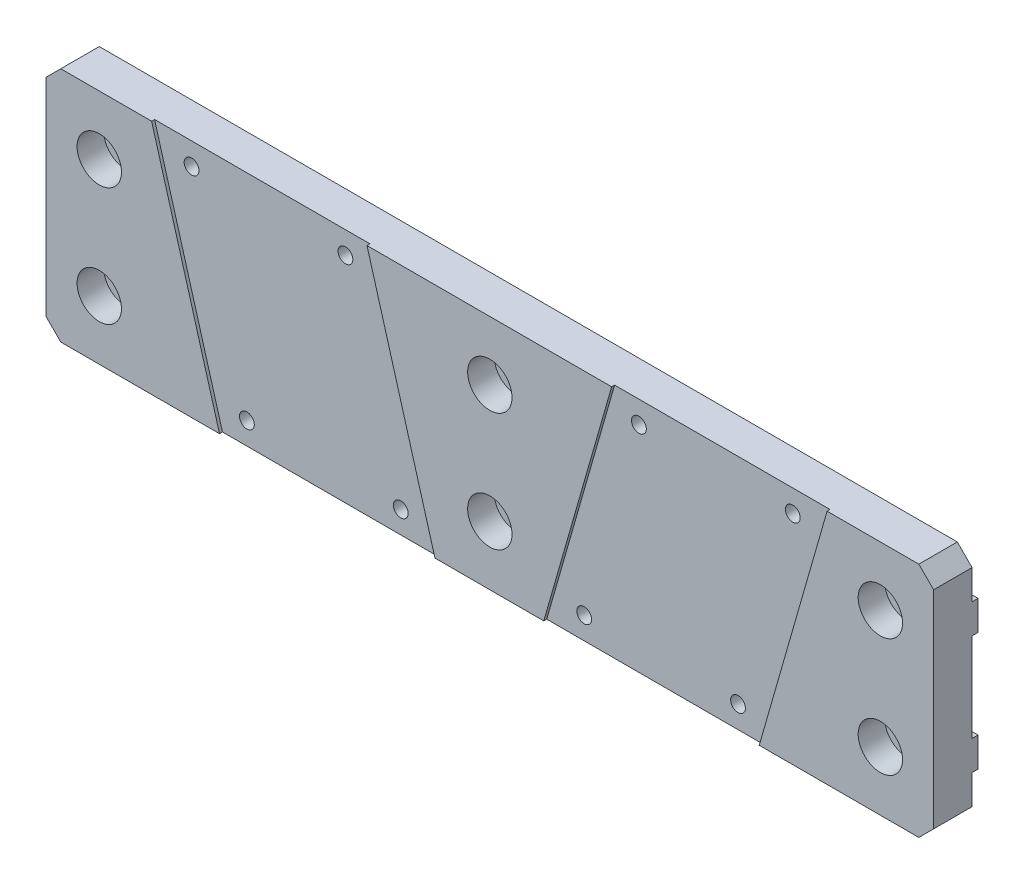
ISO-10303-21;
HEADER;
FILE_DESCRIPTION(('STEP AP214'),'2;1');
FILE_NAME('part.step','',(''),(''),'','','');
FILE_SCHEMA(('AUTOMOTIVE_DESIGN { 1 0 10303 214 1 1 1 1 }'));
ENDSEC;
DATA;
#1=APPLICATION_CONTEXT('core data for automotive mechanical design processes');
#2=APPLICATION_PROTOCOL_DEFINITION('international standard','automotive_design',2000,#1);
#3=PRODUCT_CONTEXT('',#1,'mechanical');
#4=PRODUCT('Part','Part','',(#3));
#5=PRODUCT_RELATED_PRODUCT_CATEGORY('part','',(#4));
#6=PRODUCT_DEFINITION_FORMATION('','',#4);
#7=PRODUCT_DEFINITION_CONTEXT('part definition',#1,'design');
#8=PRODUCT_DEFINITION('design','',#6,#7);
#9=PRODUCT_DEFINITION_SHAPE('','',#8);
#10=(LENGTH_UNIT() NAMED_UNIT(*) SI_UNIT(.MILLI.,.METRE.));
#11=(NAMED_UNIT(*) PLANE_ANGLE_UNIT() SI_UNIT($,.RADIAN.));
#12=(NAMED_UNIT(*) SI_UNIT($,.STERADIAN.) SOLID_ANGLE_UNIT());
#13=UNCERTAINTY_MEASURE_WITH_UNIT(LENGTH_MEASURE(1.E-05),#10,'distance_accuracy_value','');
#14=(GEOMETRIC_REPRESENTATION_CONTEXT(3) GLOBAL_UNCERTAINTY_ASSIGNED_CONTEXT((#13)) GLOBAL_UNIT_ASSIGNED_CONTEXT((#10,
#11,#12)) REPRESENTATION_CONTEXT('',''));
#15=CARTESIAN_POINT('',(0.,0.,0.));
#16=DIRECTION('',(0.,0.,1.));
#17=DIRECTION('',(1.,0.,0.));
#18=AXIS2_PLACEMENT_3D('',#15,#16,#17);
#19=CARTESIAN_POINT('',(0.,0.,0.));
#20=DIRECTION('',(0.,0.,-1.));
#21=DIRECTION('',(-1.,0.,0.));
#22=AXIS2_PLACEMENT_3D('',#19,#20,#21);
#23=PLANE('',#22);
#24=CARTESIAN_POINT('',(93.6480387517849,-32.5,0.));
#25=DIRECTION('',(0.,0.,-1.));
#26=DIRECTION('',(-1.,0.,0.));
#27=AXIS2_PLACEMENT_3D('',#24,#25,#26);
#28=CIRCLE('',#27,2.5);
#29=CARTESIAN_POINT('',(91.1480387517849,-32.5,0.));
#30=VERTEX_POINT('',#29);
#31=EDGE_CURVE('E741',#30,#30,#28,.T.);
#32=ORIENTED_EDGE('',*,*,#31,.F.);
#33=EDGE_LOOP('',(#32));
#34=FACE_BOUND('',#33,.T.);
#35=CARTESIAN_POINT('',(145.648038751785,-32.5,0.));
#36=DIRECTION('',(0.,0.,-1.));
#37=DIRECTION('',(-1.,0.,0.));
#38=AXIS2_PLACEMENT_3D('',#35,#36,#37);
#39=CIRCLE('',#38,2.5);
#40=CARTESIAN_POINT('',(143.148038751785,-32.5,0.));
#41=VERTEX_POINT('',#40);
#42=EDGE_CURVE('E747',#41,#41,#39,.T.);
#43=ORIENTED_EDGE('',*,*,#42,.F.);
#44=EDGE_LOOP('',(#43));
#45=FACE_BOUND('',#44,.T.);
#46=CARTESIAN_POINT('',(207.648038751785,-32.5,0.));
#47=DIRECTION('',(0.,0.,-1.));
#48=DIRECTION('',(-1.,0.,0.));
#49=AXIS2_PLACEMENT_3D('',#46,#47,#48);
#50=CIRCLE('',#49,2.5);
#51=CARTESIAN_POINT('',(205.148038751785,-32.5,0.));
#52=VERTEX_POINT('',#51);
#53=EDGE_CURVE('E765',#52,#52,#50,.T.);
#54=ORIENTED_EDGE('',*,*,#53,.F.);
#55=EDGE_LOOP('',(#54));
#56=FACE_BOUND('',#55,.T.);
#57=CARTESIAN_POINT('',(259.648038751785,-32.5,0.));
#58=DIRECTION('',(0.,0.,-1.));
#59=DIRECTION('',(-1.,0.,0.));
#60=AXIS2_PLACEMENT_3D('',#57,#58,#59);
#61=CIRCLE('',#60,2.5);
#62=CARTESIAN_POINT('',(257.148038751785,-32.5,0.));
#63=VERTEX_POINT('',#62);
#64=EDGE_CURVE('E20',#63,#63,#61,.T.);
#65=ORIENTED_EDGE('',*,*,#64,.F.);
#66=EDGE_LOOP('',(#65));
#67=FACE_BOUND('',#66,.T.);
#68=DIRECTION('',(1.,0.,0.));
#69=VECTOR('',#68,1.);
#70=CARTESIAN_POINT('',(26.748038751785,-40.,0.));
#71=LINE('',#70,#69);
#72=CARTESIAN_POINT('',(31.748038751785,-40.,0.));
#73=VERTEX_POINT('',#72);
#74=CARTESIAN_POINT('',(321.748038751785,-40.,0.));
#75=VERTEX_POINT('',#74);
#76=EDGE_CURVE('E322',#73,#75,#71,.T.);
#77=ORIENTED_EDGE('',*,*,#76,.F.);
#78=DIRECTION('',(0.707106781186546,-0.70710678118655,0.));
#79=VECTOR('',#78,1.);
#80=CARTESIAN_POINT('',(-4.12598062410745,-4.12598062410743,0.));
#81=LINE('',#80,#79);
#82=CARTESIAN_POINT('',(26.748038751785,-35.,0.));
#83=VERTEX_POINT('',#82);
#84=EDGE_CURVE('E337',#73,#83,#81,.F.);
#85=ORIENTED_EDGE('',*,*,#84,.T.);
#86=DIRECTION('',(0.,-1.,0.));
#87=VECTOR('',#86,1.);
#88=CARTESIAN_POINT('',(26.748038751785,-40.,0.));
#89=LINE('',#88,#87);
#90=CARTESIAN_POINT('',(26.748038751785,-25.,-4.61436444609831E-13));
#91=VERTEX_POINT('',#90);
#92=EDGE_CURVE('E316',#91,#83,#89,.T.);
#93=ORIENTED_EDGE('',*,*,#92,.F.);
#94=DIRECTION('',(1.,0.,0.));
#95=VECTOR('',#94,1.);
#96=CARTESIAN_POINT('',(26.748038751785,-25.,-4.61436444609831E-13));
#97=LINE('',#96,#95);
#98=CARTESIAN_POINT('',(326.748038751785,-25.,-4.61436444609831E-13));
#99=VERTEX_POINT('',#98);
#100=EDGE_CURVE('E272',#91,#99,#97,.T.);
#101=ORIENTED_EDGE('',*,*,#100,.T.);
#102=DIRECTION('',(0.,1.,0.));
#103=VECTOR('',#102,1.);
#104=CARTESIAN_POINT('',(326.748038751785,-40.,0.));
#105=LINE('',#104,#103);
#106=CARTESIAN_POINT('',(326.748038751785,-35.,0.));
#107=VERTEX_POINT('',#106);
#108=EDGE_CURVE('E314',#107,#99,#105,.T.);
#109=ORIENTED_EDGE('',*,*,#108,.F.);
#110=DIRECTION('',(0.707106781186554,0.707106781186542,0.));
#111=VECTOR('',#110,1.);
#112=CARTESIAN_POINT('',(180.87401937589,-180.874019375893,0.));
#113=LINE('',#112,#111);
#114=EDGE_CURVE('E335',#107,#75,#113,.F.);
#115=ORIENTED_EDGE('',*,*,#114,.T.);
#116=EDGE_LOOP('',(#77,#85,#93,#101,#109,#115));
#117=FACE_BOUND('',#116,.T.);
#118=ADVANCED_FACE('F16',(#34,#45,#56,#67,#117),#23,.T.);
#119=DIRECTION('',(1.,0.,0.));
#120=VECTOR('',#119,1.);
#121=CARTESIAN_POINT('',(26.748038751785,-15.,-2.78816156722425E-13));
#122=LINE('',#121,#120);
#123=CARTESIAN_POINT('',(26.748038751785,-15.,-2.78816156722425E-13));
#124=VERTEX_POINT('',#123);
#125=CARTESIAN_POINT('',(326.748038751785,-15.,0.));
#126=VERTEX_POINT('',#125);
#127=EDGE_CURVE('E276',#124,#126,#122,.T.);
#128=ORIENTED_EDGE('',*,*,#127,.F.);
#129=CARTESIAN_POINT('',(26.748038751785,15.,0.));
#130=VERTEX_POINT('',#129);
#131=EDGE_CURVE('E395',#130,#124,#89,.T.);
#132=ORIENTED_EDGE('',*,*,#131,.F.);
#133=DIRECTION('',(1.,0.,0.));
#134=VECTOR('',#133,1.);
#135=CARTESIAN_POINT('',(26.748038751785,15.,0.));
#136=LINE('',#135,#134);
#137=CARTESIAN_POINT('',(326.748038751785,15.,0.));
#138=VERTEX_POINT('',#137);
#139=EDGE_CURVE('E304',#130,#138,#136,.T.);
#140=ORIENTED_EDGE('',*,*,#139,.T.);
#141=EDGE_CURVE('E311',#126,#138,#105,.T.);
#142=ORIENTED_EDGE('',*,*,#141,.F.);
#143=EDGE_LOOP('',(#128,#132,#140,#142));
#144=FACE_BOUND('',#143,.T.);
#145=ADVANCED_FACE('F509',(#144),#23,.T.);
#146=CARTESIAN_POINT('',(0.,0.,13.));
#147=DIRECTION('',(0.,0.,-1.));
#148=DIRECTION('',(-1.,0.,0.));
#149=AXIS2_PLACEMENT_3D('',#146,#147,#148);
#150=PLANE('',#149);
#151=CARTESIAN_POINT('',(176.748038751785,20.,13.));
#152=DIRECTION('',(0.,0.,1.));
#153=DIRECTION('',(1.,0.,0.));
#154=AXIS2_PLACEMENT_3D('',#151,#152,#153);
#155=CIRCLE('',#154,7.5);
#156=CARTESIAN_POINT('',(184.248038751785,20.,13.));
#157=VERTEX_POINT('',#156);
#158=EDGE_CURVE('E215',#157,#157,#155,.T.);
#159=ORIENTED_EDGE('',*,*,#158,.F.);
#160=EDGE_LOOP('',(#159));
#161=FACE_BOUND('',#160,.T.);
#162=CARTESIAN_POINT('',(176.748038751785,-20.,13.));
#163=DIRECTION('',(0.,0.,1.));
#164=DIRECTION('',(1.,0.,0.));
#165=AXIS2_PLACEMENT_3D('',#162,#163,#164);
#166=CIRCLE('',#165,7.5);
#167=CARTESIAN_POINT('',(184.248038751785,-20.,13.));
#168=VERTEX_POINT('',#167);
#169=EDGE_CURVE('E225',#168,#168,#166,.T.);
#170=ORIENTED_EDGE('',*,*,#169,.F.);
#171=EDGE_LOOP('',(#170));
#172=FACE_BOUND('',#171,.T.);
#173=DIRECTION('',(1.,0.,0.));
#174=VECTOR('',#173,1.);
#175=CARTESIAN_POINT('',(26.748038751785,-40.,13.));
#176=LINE('',#175,#174);
#177=CARTESIAN_POINT('',(158.208429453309,-40.,13.));
#178=VERTEX_POINT('',#177);
#179=CARTESIAN_POINT('',(194.985221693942,-40.,13.));
#180=VERTEX_POINT('',#179);
#181=EDGE_CURVE('E444',#178,#180,#176,.T.);
#182=ORIENTED_EDGE('',*,*,#181,.T.);
#183=DIRECTION('',(-0.275637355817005,-0.961261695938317,0.));
#184=VECTOR('',#183,1.);
#185=CARTESIAN_POINT('',(194.833044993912,-40.5307032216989,13.));
#186=LINE('',#185,#184);
#187=CARTESIAN_POINT('',(217.924852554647,40.,13.));
#188=VERTEX_POINT('',#187);
#189=EDGE_CURVE('E452',#188,#180,#186,.T.);
#190=ORIENTED_EDGE('',*,*,#189,.F.);
#191=DIRECTION('',(-1.,0.,0.));
#192=VECTOR('',#191,1.);
#193=CARTESIAN_POINT('',(26.748038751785,40.,13.));
#194=LINE('',#193,#192);
#195=CARTESIAN_POINT('',(135.238548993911,40.,13.));
#196=VERTEX_POINT('',#195);
#197=EDGE_CURVE('E362',#188,#196,#194,.T.);
#198=ORIENTED_EDGE('',*,*,#197,.T.);
#199=DIRECTION('',(0.275973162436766,-0.961165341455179,0.));
#200=VECTOR('',#199,1.);
#201=CARTESIAN_POINT('',(135.548854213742,38.9192622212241,13.));
#202=LINE('',#201,#200);
#203=EDGE_CURVE('E361',#196,#178,#202,.T.);
#204=ORIENTED_EDGE('',*,*,#203,.T.);
#205=EDGE_LOOP('',(#182,#190,#198,#204));
#206=FACE_BOUND('',#205,.T.);
#207=ADVANCED_FACE('F451',(#161,#172,#206),#150,.F.);
#208=CARTESIAN_POINT('',(308.748038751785,20.,13.));
#209=DIRECTION('',(0.,0.,1.));
#210=DIRECTION('',(1.,0.,0.));
#211=AXIS2_PLACEMENT_3D('',#208,#209,#210);
#212=CIRCLE('',#211,7.5);
#213=CARTESIAN_POINT('',(316.248038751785,20.,13.));
#214=VERTEX_POINT('',#213);
#215=EDGE_CURVE('E235',#214,#214,#212,.T.);
#216=ORIENTED_EDGE('',*,*,#215,.F.);
#217=EDGE_LOOP('',(#216));
#218=FACE_BOUND('',#217,.T.);
#219=CARTESIAN_POINT('',(308.748038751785,-20.,13.));
#220=DIRECTION('',(0.,0.,1.));
#221=DIRECTION('',(1.,0.,0.));
#222=AXIS2_PLACEMENT_3D('',#219,#220,#221);
#223=CIRCLE('',#222,7.5);
#224=CARTESIAN_POINT('',(316.248038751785,-20.,13.));
#225=VERTEX_POINT('',#224);
#226=EDGE_CURVE('E245',#225,#225,#223,.T.);
#227=ORIENTED_EDGE('',*,*,#226,.F.);
#228=EDGE_LOOP('',(#227));
#229=FACE_BOUND('',#228,.T.);
#230=CARTESIAN_POINT('',(267.806182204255,-40.,13.));
#231=VERTEX_POINT('',#230);
#232=CARTESIAN_POINT('',(321.748038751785,-40.,13.));
#233=VERTEX_POINT('',#232);
#234=EDGE_CURVE('E442',#231,#233,#176,.T.);
#235=ORIENTED_EDGE('',*,*,#234,.T.);
#236=DIRECTION('',(-0.707106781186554,-0.707106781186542,0.));
#237=VECTOR('',#236,1.);
#238=CARTESIAN_POINT('',(326.748038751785,-35.,13.));
#239=LINE('',#238,#237);
#240=CARTESIAN_POINT('',(326.748038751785,-35.,13.));
#241=VERTEX_POINT('',#240);
#242=EDGE_CURVE('E11',#233,#241,#239,.F.);
#243=ORIENTED_EDGE('',*,*,#242,.T.);
#244=DIRECTION('',(0.,1.,0.));
#245=VECTOR('',#244,1.);
#246=CARTESIAN_POINT('',(326.748038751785,-40.,13.));
#247=LINE('',#246,#245);
#248=CARTESIAN_POINT('',(326.748038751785,35.,13.));
#249=VERTEX_POINT('',#248);
#250=EDGE_CURVE('E349',#241,#249,#247,.T.);
#251=ORIENTED_EDGE('',*,*,#250,.T.);
#252=DIRECTION('',(0.707106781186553,-0.707106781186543,0.));
#253=VECTOR('',#252,1.);
#254=CARTESIAN_POINT('',(321.748038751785,40.,13.));
#255=LINE('',#254,#253);
#256=CARTESIAN_POINT('',(321.748038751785,40.,13.));
#257=VERTEX_POINT('',#256);
#258=EDGE_CURVE('E25',#249,#257,#255,.F.);
#259=ORIENTED_EDGE('',*,*,#258,.T.);
#260=CARTESIAN_POINT('',(290.74581306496,40.,13.));
#261=VERTEX_POINT('',#260);
#262=EDGE_CURVE('E347',#257,#261,#194,.T.);
#263=ORIENTED_EDGE('',*,*,#262,.T.);
#264=DIRECTION('',(0.275637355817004,0.961261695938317,0.));
#265=VECTOR('',#264,1.);
#266=CARTESIAN_POINT('',(262.121363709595,-59.8253181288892,13.));
#267=LINE('',#266,#265);
#268=EDGE_CURVE('E299',#231,#261,#267,.T.);
#269=ORIENTED_EDGE('',*,*,#268,.F.);
#270=EDGE_LOOP('',(#235,#243,#251,#259,#263,#269));
#271=FACE_BOUND('',#270,.T.);
#272=ADVANCED_FACE('F345',(#218,#229,#271),#150,.F.);
#273=CARTESIAN_POINT('',(26.748038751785,-40.,13.));
#274=DIRECTION('',(1.,0.,0.));
#275=DIRECTION('',(0.,0.,-1.));
#276=AXIS2_PLACEMENT_3D('',#273,#274,#275);
#277=PLANE('',#276);
#278=CARTESIAN_POINT('',(26.748038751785,0.,6.));
#279=DIRECTION('',(-1.,0.,0.));
#280=DIRECTION('',(0.,0.,1.));
#281=AXIS2_PLACEMENT_3D('',#278,#279,#280);
#282=CIRCLE('',#281,2.5);
#283=CARTESIAN_POINT('',(26.748038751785,0.,8.5));
#284=VERTEX_POINT('',#283);
#285=EDGE_CURVE('E190',#284,#284,#282,.T.);
#286=ORIENTED_EDGE('',*,*,#285,.F.);
#287=EDGE_LOOP('',(#286));
#288=FACE_BOUND('',#287,.T.);
#289=DIRECTION('',(0.,-1.,0.));
#290=VECTOR('',#289,1.);
#291=CARTESIAN_POINT('',(26.748038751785,-40.,13.));
#292=LINE('',#291,#290);
#293=CARTESIAN_POINT('',(26.748038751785,35.,13.));
#294=VERTEX_POINT('',#293);
#295=CARTESIAN_POINT('',(26.748038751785,-35.,13.));
#296=VERTEX_POINT('',#295);
#297=EDGE_CURVE('E435',#294,#296,#292,.T.);
#298=ORIENTED_EDGE('',*,*,#297,.F.);
#299=DIRECTION('',(0.,0.,-1.));
#300=VECTOR('',#299,1.);
#301=CARTESIAN_POINT('',(26.748038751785,35.,13.));
#302=LINE('',#301,#300);
#303=CARTESIAN_POINT('',(26.748038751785,35.,0.));
#304=VERTEX_POINT('',#303);
#305=EDGE_CURVE('E416',#294,#304,#302,.T.);
#306=ORIENTED_EDGE('',*,*,#305,.T.);
#307=CARTESIAN_POINT('',(26.748038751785,25.,0.));
#308=VERTEX_POINT('',#307);
#309=EDGE_CURVE('E394',#304,#308,#89,.T.);
#310=ORIENTED_EDGE('',*,*,#309,.T.);
#311=DIRECTION('',(0.,0.,1.));
#312=VECTOR('',#311,1.);
#313=CARTESIAN_POINT('',(26.748038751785,25.,0.));
#314=LINE('',#313,#312);
#315=CARTESIAN_POINT('',(26.748038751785,25.,-2.));
#316=VERTEX_POINT('',#315);
#317=EDGE_CURVE('E285',#316,#308,#314,.T.);
#318=ORIENTED_EDGE('',*,*,#317,.F.);
#319=DIRECTION('',(0.,1.,0.));
#320=VECTOR('',#319,1.);
#321=CARTESIAN_POINT('',(26.748038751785,25.,-2.));
#322=LINE('',#321,#320);
#323=CARTESIAN_POINT('',(26.748038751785,15.,-2.));
#324=VERTEX_POINT('',#323);
#325=EDGE_CURVE('E282',#324,#316,#322,.T.);
#326=ORIENTED_EDGE('',*,*,#325,.F.);
#327=DIRECTION('',(0.,0.,-1.));
#328=VECTOR('',#327,1.);
#329=CARTESIAN_POINT('',(26.748038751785,15.,0.));
#330=LINE('',#329,#328);
#331=EDGE_CURVE('E286',#130,#324,#330,.T.);
#332=ORIENTED_EDGE('',*,*,#331,.F.);
#333=ORIENTED_EDGE('',*,*,#131,.T.);
#334=DIRECTION('',(0.,0.,1.));
#335=VECTOR('',#334,1.);
#336=CARTESIAN_POINT('',(26.748038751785,-15.,-2.78816156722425E-13));
#337=LINE('',#336,#335);
#338=CARTESIAN_POINT('',(26.748038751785,-14.9999999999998,-2.00000000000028));
#339=VERTEX_POINT('',#338);
#340=EDGE_CURVE('E262',#339,#124,#337,.T.);
#341=ORIENTED_EDGE('',*,*,#340,.F.);
#342=DIRECTION('',(0.,1.,0.));
#343=VECTOR('',#342,1.);
#344=CARTESIAN_POINT('',(26.748038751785,-25.,-2.00000000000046));
#345=LINE('',#344,#343);
#346=CARTESIAN_POINT('',(26.748038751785,-25.,-2.00000000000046));
#347=VERTEX_POINT('',#346);
#348=EDGE_CURVE('E258',#347,#339,#345,.T.);
#349=ORIENTED_EDGE('',*,*,#348,.F.);
#350=DIRECTION('',(0.,0.,-1.));
#351=VECTOR('',#350,1.);
#352=CARTESIAN_POINT('',(26.748038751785,-25.,-4.61436444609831E-13));
#353=LINE('',#352,#351);
#354=EDGE_CURVE('E255',#91,#347,#353,.T.);
#355=ORIENTED_EDGE('',*,*,#354,.F.);
#356=ORIENTED_EDGE('',*,*,#92,.T.);
#357=DIRECTION('',(0.,0.,1.));
#358=VECTOR('',#357,1.);
#359=CARTESIAN_POINT('',(26.748038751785,-35.,13.));
#360=LINE('',#359,#358);
#361=EDGE_CURVE('E405',#83,#296,#360,.T.);
#362=ORIENTED_EDGE('',*,*,#361,.T.);
#363=EDGE_LOOP('',(#298,#306,#310,#318,#326,#332,#333,#341,#349,#355,#356,#362));
#364=FACE_BOUND('',#363,.T.);
#365=ADVANCED_FACE('F441',(#288,#364),#277,.F.);
#366=CARTESIAN_POINT('',(26.748038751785,-40.,13.));
#367=DIRECTION('',(0.,1.,0.));
#368=DIRECTION('',(-1.,0.,0.));
#369=AXIS2_PLACEMENT_3D('',#366,#367,#368);
#370=PLANE('',#369);
#371=CARTESIAN_POINT('',(31.748038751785,-40.,13.));
#372=VERTEX_POINT('',#371);
#373=CARTESIAN_POINT('',(85.3876696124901,-40.,13.));
#374=VERTEX_POINT('',#373);
#375=EDGE_CURVE('E387',#372,#374,#176,.T.);
#376=ORIENTED_EDGE('',*,*,#375,.F.);
#377=DIRECTION('',(0.,0.,-1.));
#378=VECTOR('',#377,1.);
#379=CARTESIAN_POINT('',(31.748038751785,-40.,13.));
#380=LINE('',#379,#378);
#381=EDGE_CURVE('E333',#372,#73,#380,.T.);
#382=ORIENTED_EDGE('',*,*,#381,.T.);
#383=ORIENTED_EDGE('',*,*,#76,.T.);
#384=DIRECTION('',(0.,0.,1.));
#385=VECTOR('',#384,1.);
#386=CARTESIAN_POINT('',(321.748038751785,-40.,13.));
#387=LINE('',#386,#385);
#388=EDGE_CURVE('E376',#75,#233,#387,.T.);
#389=ORIENTED_EDGE('',*,*,#388,.T.);
#390=ORIENTED_EDGE('',*,*,#234,.F.);
#391=DIRECTION('',(0.,0.,-1.));
#392=VECTOR('',#391,1.);
#393=CARTESIAN_POINT('',(267.806182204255,-40.,13.));
#394=LINE('',#393,#392);
#395=CARTESIAN_POINT('',(267.806182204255,-40.,12.));
#396=VERTEX_POINT('',#395);
#397=EDGE_CURVE('E488',#231,#396,#394,.T.);
#398=ORIENTED_EDGE('',*,*,#397,.T.);
#399=DIRECTION('',(1.,0.,0.));
#400=VECTOR('',#399,1.);
#401=CARTESIAN_POINT('',(26.748038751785,-40.,12.));
#402=LINE('',#401,#400);
#403=CARTESIAN_POINT('',(194.985221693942,-40.,12.));
#404=VERTEX_POINT('',#403);
#405=EDGE_CURVE('E492',#404,#396,#402,.T.);
#406=ORIENTED_EDGE('',*,*,#405,.F.);
#407=DIRECTION('',(0.,0.,1.));
#408=VECTOR('',#407,1.);
#409=CARTESIAN_POINT('',(194.985221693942,-40.,13.));
#410=LINE('',#409,#408);
#411=EDGE_CURVE('E484',#404,#180,#410,.T.);
#412=ORIENTED_EDGE('',*,*,#411,.T.);
#413=ORIENTED_EDGE('',*,*,#181,.F.);
#414=DIRECTION('',(0.,0.,-1.));
#415=VECTOR('',#414,1.);
#416=CARTESIAN_POINT('',(158.208429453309,-40.,13.));
#417=LINE('',#416,#415);
#418=CARTESIAN_POINT('',(158.208429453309,-40.,12.));
#419=VERTEX_POINT('',#418);
#420=EDGE_CURVE('E462',#178,#419,#417,.T.);
#421=ORIENTED_EDGE('',*,*,#420,.T.);
#422=DIRECTION('',(1.,0.,0.));
#423=VECTOR('',#422,1.);
#424=CARTESIAN_POINT('',(26.748038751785,-40.,12.));
#425=LINE('',#424,#423);
#426=CARTESIAN_POINT('',(85.3876696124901,-40.,12.));
#427=VERTEX_POINT('',#426);
#428=EDGE_CURVE('E447',#427,#419,#425,.T.);
#429=ORIENTED_EDGE('',*,*,#428,.F.);
#430=DIRECTION('',(0.,0.,1.));
#431=VECTOR('',#430,1.);
#432=CARTESIAN_POINT('',(85.3876696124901,-40.,13.));
#433=LINE('',#432,#431);
#434=EDGE_CURVE('E466',#427,#374,#433,.T.);
#435=ORIENTED_EDGE('',*,*,#434,.T.);
#436=EDGE_LOOP('',(#376,#382,#383,#389,#390,#398,#406,#412,#413,#421,#429,#435));
#437=FACE_BOUND('',#436,.T.);
#438=ADVANCED_FACE('F385',(#437),#370,.F.);
#439=CARTESIAN_POINT('',(326.748038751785,-40.,13.));
#440=DIRECTION('',(-1.,0.,0.));
#441=DIRECTION('',(0.,0.,1.));
#442=AXIS2_PLACEMENT_3D('',#439,#440,#441);
#443=PLANE('',#442);
#444=ORIENTED_EDGE('',*,*,#250,.F.);
#445=DIRECTION('',(0.,0.,-1.));
#446=VECTOR('',#445,1.);
#447=CARTESIAN_POINT('',(326.748038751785,-35.,13.));
#448=LINE('',#447,#446);
#449=EDGE_CURVE('E340',#241,#107,#448,.T.);
#450=ORIENTED_EDGE('',*,*,#449,.T.);
#451=ORIENTED_EDGE('',*,*,#108,.T.);
#452=DIRECTION('',(0.,0.,-1.));
#453=VECTOR('',#452,1.);
#454=CARTESIAN_POINT('',(326.748038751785,-25.,-4.61436444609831E-13));
#455=LINE('',#454,#453);
#456=CARTESIAN_POINT('',(326.748038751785,-25.,-2.00000000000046));
#457=VERTEX_POINT('',#456);
#458=EDGE_CURVE('E265',#99,#457,#455,.T.);
#459=ORIENTED_EDGE('',*,*,#458,.T.);
#460=DIRECTION('',(0.,1.,0.));
#461=VECTOR('',#460,1.);
#462=CARTESIAN_POINT('',(326.748038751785,-25.,-2.00000000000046));
#463=LINE('',#462,#461);
#464=CARTESIAN_POINT('',(326.748038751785,-14.9999999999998,-2.00000000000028));
#465=VERTEX_POINT('',#464);
#466=EDGE_CURVE('E268',#457,#465,#463,.T.);
#467=ORIENTED_EDGE('',*,*,#466,.T.);
#468=DIRECTION('',(0.,0.,1.));
#469=VECTOR('',#468,1.);
#470=CARTESIAN_POINT('',(326.748038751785,-15.,-2.78816156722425E-13));
#471=LINE('',#470,#469);
#472=EDGE_CURVE('E259',#465,#126,#471,.T.);
#473=ORIENTED_EDGE('',*,*,#472,.T.);
#474=ORIENTED_EDGE('',*,*,#141,.T.);
#475=DIRECTION('',(0.,0.,-1.));
#476=VECTOR('',#475,1.);
#477=CARTESIAN_POINT('',(326.748038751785,15.,0.));
#478=LINE('',#477,#476);
#479=CARTESIAN_POINT('',(326.748038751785,15.,-2.));
#480=VERTEX_POINT('',#479);
#481=EDGE_CURVE('E275',#138,#480,#478,.T.);
#482=ORIENTED_EDGE('',*,*,#481,.T.);
#483=DIRECTION('',(0.,1.,0.));
#484=VECTOR('',#483,1.);
#485=CARTESIAN_POINT('',(326.748038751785,25.,-2.));
#486=LINE('',#485,#484);
#487=CARTESIAN_POINT('',(326.748038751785,25.,-2.));
#488=VERTEX_POINT('',#487);
#489=EDGE_CURVE('E287',#480,#488,#486,.T.);
#490=ORIENTED_EDGE('',*,*,#489,.T.);
#491=DIRECTION('',(0.,0.,1.));
#492=VECTOR('',#491,1.);
#493=CARTESIAN_POINT('',(326.748038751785,25.,0.));
#494=LINE('',#493,#492);
#495=CARTESIAN_POINT('',(326.748038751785,25.,0.));
#496=VERTEX_POINT('',#495);
#497=EDGE_CURVE('E290',#488,#496,#494,.T.);
#498=ORIENTED_EDGE('',*,*,#497,.T.);
#499=CARTESIAN_POINT('',(326.748038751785,35.,0.));
#500=VERTEX_POINT('',#499);
#501=EDGE_CURVE('E315',#496,#500,#105,.T.);
#502=ORIENTED_EDGE('',*,*,#501,.T.);
#503=DIRECTION('',(0.,0.,1.));
#504=VECTOR('',#503,1.);
#505=CARTESIAN_POINT('',(326.748038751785,35.,13.));
#506=LINE('',#505,#504);
#507=EDGE_CURVE('E32',#500,#249,#506,.T.);
#508=ORIENTED_EDGE('',*,*,#507,.T.);
#509=EDGE_LOOP('',(#444,#450,#451,#459,#467,#473,#474,#482,#490,#498,#502,#508));
#510=FACE_BOUND('',#509,.T.);
#511=ADVANCED_FACE('F425',(#510),#443,.F.);
#512=CARTESIAN_POINT('',(26.748038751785,40.,13.));
#513=DIRECTION('',(0.,-1.,0.));
#514=DIRECTION('',(1.,0.,0.));
#515=AXIS2_PLACEMENT_3D('',#512,#513,#514);
#516=PLANE('',#515);
#517=DIRECTION('',(-1.,0.,0.));
#518=VECTOR('',#517,1.);
#519=CARTESIAN_POINT('',(26.748038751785,40.,0.));
#520=LINE('',#519,#518);
#521=CARTESIAN_POINT('',(321.748038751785,40.,0.));
#522=VERTEX_POINT('',#521);
#523=CARTESIAN_POINT('',(31.748038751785,40.,0.));
#524=VERTEX_POINT('',#523);
#525=EDGE_CURVE('E323',#522,#524,#520,.T.);
#526=ORIENTED_EDGE('',*,*,#525,.T.);
#527=DIRECTION('',(0.,0.,1.));
#528=VECTOR('',#527,1.);
#529=CARTESIAN_POINT('',(31.748038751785,40.,13.));
#530=LINE('',#529,#528);
#531=CARTESIAN_POINT('',(31.748038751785,40.,13.));
#532=VERTEX_POINT('',#531);
#533=EDGE_CURVE('E366',#524,#532,#530,.T.);
#534=ORIENTED_EDGE('',*,*,#533,.T.);
#535=CARTESIAN_POINT('',(62.4480387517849,40.,13.));
#536=VERTEX_POINT('',#535);
#537=EDGE_CURVE('E364',#536,#532,#194,.T.);
#538=ORIENTED_EDGE('',*,*,#537,.F.);
#539=DIRECTION('',(0.,0.,1.));
#540=VECTOR('',#539,1.);
#541=CARTESIAN_POINT('',(62.4480387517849,40.,12.));
#542=LINE('',#541,#540);
#543=CARTESIAN_POINT('',(62.4480387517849,40.,12.));
#544=VERTEX_POINT('',#543);
#545=EDGE_CURVE('E467',#544,#536,#542,.T.);
#546=ORIENTED_EDGE('',*,*,#545,.F.);
#547=DIRECTION('',(-1.,0.,0.));
#548=VECTOR('',#547,1.);
#549=CARTESIAN_POINT('',(62.4480387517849,40.,12.));
#550=LINE('',#549,#548);
#551=CARTESIAN_POINT('',(135.238548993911,40.,12.));
#552=VERTEX_POINT('',#551);
#553=EDGE_CURVE('E465',#552,#544,#550,.T.);
#554=ORIENTED_EDGE('',*,*,#553,.F.);
#555=DIRECTION('',(0.,0.,1.));
#556=VECTOR('',#555,1.);
#557=CARTESIAN_POINT('',(135.238548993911,40.,12.));
#558=LINE('',#557,#556);
#559=EDGE_CURVE('E459',#552,#196,#558,.T.);
#560=ORIENTED_EDGE('',*,*,#559,.T.);
#561=ORIENTED_EDGE('',*,*,#197,.F.);
#562=DIRECTION('',(0.,0.,1.));
#563=VECTOR('',#562,1.);
#564=CARTESIAN_POINT('',(217.924852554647,40.,12.));
#565=LINE('',#564,#563);
#566=CARTESIAN_POINT('',(217.924852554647,40.,12.));
#567=VERTEX_POINT('',#566);
#568=EDGE_CURVE('E582',#567,#188,#565,.T.);
#569=ORIENTED_EDGE('',*,*,#568,.F.);
#570=DIRECTION('',(-1.,0.,0.));
#571=VECTOR('',#570,1.);
#572=CARTESIAN_POINT('',(217.924852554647,40.,12.));
#573=LINE('',#572,#571);
#574=CARTESIAN_POINT('',(290.74581306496,40.,12.));
#575=VERTEX_POINT('',#574);
#576=EDGE_CURVE('E575',#575,#567,#573,.T.);
#577=ORIENTED_EDGE('',*,*,#576,.F.);
#578=DIRECTION('',(0.,0.,1.));
#579=VECTOR('',#578,1.);
#580=CARTESIAN_POINT('',(290.74581306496,40.,12.));
#581=LINE('',#580,#579);
#582=EDGE_CURVE('E360',#575,#261,#581,.T.);
#583=ORIENTED_EDGE('',*,*,#582,.T.);
#584=ORIENTED_EDGE('',*,*,#262,.F.);
#585=DIRECTION('',(0.,0.,-1.));
#586=VECTOR('',#585,1.);
#587=CARTESIAN_POINT('',(321.748038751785,40.,13.));
#588=LINE('',#587,#586);
#589=EDGE_CURVE('E357',#257,#522,#588,.T.);
#590=ORIENTED_EDGE('',*,*,#589,.T.);
#591=EDGE_LOOP('',(#526,#534,#538,#546,#554,#560,#561,#569,#577,#583,#584,#590));
#592=FACE_BOUND('',#591,.T.);
#593=ADVANCED_FACE('F356',(#592),#516,.F.);
#594=CARTESIAN_POINT('',(44.748038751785,20.,13.));
#595=DIRECTION('',(0.,0.,1.));
#596=DIRECTION('',(1.,0.,0.));
#597=AXIS2_PLACEMENT_3D('',#594,#595,#596);
#598=CIRCLE('',#597,7.5);
#599=CARTESIAN_POINT('',(52.248038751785,20.,13.));
#600=VERTEX_POINT('',#599);
#601=EDGE_CURVE('E189',#600,#600,#598,.T.);
#602=ORIENTED_EDGE('',*,*,#601,.F.);
#603=EDGE_LOOP('',(#602));
#604=FACE_BOUND('',#603,.T.);
#605=CARTESIAN_POINT('',(44.748038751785,-20.,13.));
#606=DIRECTION('',(0.,0.,1.));
#607=DIRECTION('',(1.,0.,0.));
#608=AXIS2_PLACEMENT_3D('',#605,#606,#607);
#609=CIRCLE('',#608,7.5);
#610=CARTESIAN_POINT('',(52.248038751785,-20.,13.));
#611=VERTEX_POINT('',#610);
#612=EDGE_CURVE('E205',#611,#611,#609,.T.);
#613=ORIENTED_EDGE('',*,*,#612,.F.);
#614=EDGE_LOOP('',(#613));
#615=FACE_BOUND('',#614,.T.);
#616=ORIENTED_EDGE('',*,*,#537,.T.);
#617=DIRECTION('',(0.707106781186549,0.707106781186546,0.));
#618=VECTOR('',#617,1.);
#619=CARTESIAN_POINT('',(26.748038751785,35.,13.));
#620=LINE('',#619,#618);
#621=EDGE_CURVE('E375',#532,#294,#620,.F.);
#622=ORIENTED_EDGE('',*,*,#621,.T.);
#623=ORIENTED_EDGE('',*,*,#297,.T.);
#624=DIRECTION('',(-0.707106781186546,0.70710678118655,0.));
#625=VECTOR('',#624,1.);
#626=CARTESIAN_POINT('',(31.748038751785,-40.,13.));
#627=LINE('',#626,#625);
#628=EDGE_CURVE('E369',#296,#372,#627,.F.);
#629=ORIENTED_EDGE('',*,*,#628,.T.);
#630=ORIENTED_EDGE('',*,*,#375,.T.);
#631=DIRECTION('',(0.275637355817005,-0.961261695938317,0.));
#632=VECTOR('',#631,1.);
#633=CARTESIAN_POINT('',(91.0724881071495,-59.825318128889,13.));
#634=LINE('',#633,#632);
#635=EDGE_CURVE('E473',#536,#374,#634,.T.);
#636=ORIENTED_EDGE('',*,*,#635,.F.);
#637=EDGE_LOOP('',(#616,#622,#623,#629,#630,#636));
#638=FACE_BOUND('',#637,.T.);
#639=ADVANCED_FACE('F439',(#604,#615,#638),#150,.F.);
#640=CARTESIAN_POINT('',(74.9480387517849,32.5,0.));
#641=DIRECTION('',(0.,0.,-1.));
#642=DIRECTION('',(-1.,0.,0.));
#643=AXIS2_PLACEMENT_3D('',#640,#641,#642);
#644=CIRCLE('',#643,2.5);
#645=CARTESIAN_POINT('',(72.4480387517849,32.5,0.));
#646=VERTEX_POINT('',#645);
#647=EDGE_CURVE('E726',#646,#646,#644,.T.);
#648=ORIENTED_EDGE('',*,*,#647,.F.);
#649=EDGE_LOOP('',(#648));
#650=FACE_BOUND('',#649,.T.);
#651=CARTESIAN_POINT('',(126.948038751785,32.5,0.));
#652=DIRECTION('',(0.,0.,-1.));
#653=DIRECTION('',(-1.,0.,0.));
#654=AXIS2_PLACEMENT_3D('',#651,#652,#653);
#655=CIRCLE('',#654,2.5);
#656=CARTESIAN_POINT('',(124.448038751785,32.5,0.));
#657=VERTEX_POINT('',#656);
#658=EDGE_CURVE('E735',#657,#657,#655,.T.);
#659=ORIENTED_EDGE('',*,*,#658,.F.);
#660=EDGE_LOOP('',(#659));
#661=FACE_BOUND('',#660,.T.);
#662=CARTESIAN_POINT('',(226.148038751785,32.5,0.));
#663=DIRECTION('',(0.,0.,-1.));
#664=DIRECTION('',(-1.,0.,0.));
#665=AXIS2_PLACEMENT_3D('',#662,#663,#664);
#666=CIRCLE('',#665,2.5);
#667=CARTESIAN_POINT('',(223.648038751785,32.5,0.));
#668=VERTEX_POINT('',#667);
#669=EDGE_CURVE('E753',#668,#668,#666,.T.);
#670=ORIENTED_EDGE('',*,*,#669,.F.);
#671=EDGE_LOOP('',(#670));
#672=FACE_BOUND('',#671,.T.);
#673=CARTESIAN_POINT('',(278.148038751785,32.5,0.));
#674=DIRECTION('',(0.,0.,-1.));
#675=DIRECTION('',(-1.,0.,0.));
#676=AXIS2_PLACEMENT_3D('',#673,#674,#675);
#677=CIRCLE('',#676,2.5);
#678=CARTESIAN_POINT('',(275.648038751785,32.5,0.));
#679=VERTEX_POINT('',#678);
#680=EDGE_CURVE('E759',#679,#679,#677,.T.);
#681=ORIENTED_EDGE('',*,*,#680,.F.);
#682=EDGE_LOOP('',(#681));
#683=FACE_BOUND('',#682,.T.);
#684=ORIENTED_EDGE('',*,*,#309,.F.);
#685=DIRECTION('',(-0.707106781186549,-0.707106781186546,0.));
#686=VECTOR('',#685,1.);
#687=CARTESIAN_POINT('',(-4.12598062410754,4.12598062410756,0.));
#688=LINE('',#687,#686);
#689=EDGE_CURVE('E367',#304,#524,#688,.F.);
#690=ORIENTED_EDGE('',*,*,#689,.T.);
#691=ORIENTED_EDGE('',*,*,#525,.F.);
#692=DIRECTION('',(-0.707106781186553,0.707106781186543,0.));
#693=VECTOR('',#692,1.);
#694=CARTESIAN_POINT('',(180.87401937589,180.874019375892,0.));
#695=LINE('',#694,#693);
#696=EDGE_CURVE('E365',#522,#500,#695,.F.);
#697=ORIENTED_EDGE('',*,*,#696,.T.);
#698=ORIENTED_EDGE('',*,*,#501,.F.);
#699=DIRECTION('',(1.,0.,0.));
#700=VECTOR('',#699,1.);
#701=CARTESIAN_POINT('',(26.748038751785,25.,0.));
#702=LINE('',#701,#700);
#703=EDGE_CURVE('E296',#308,#496,#702,.T.);
#704=ORIENTED_EDGE('',*,*,#703,.F.);
#705=EDGE_LOOP('',(#684,#690,#691,#697,#698,#704));
#706=FACE_BOUND('',#705,.T.);
#707=ADVANCED_FACE('F423',(#650,#661,#672,#683,#706),#23,.T.);
#708=CARTESIAN_POINT('',(0.,0.,12.));
#709=DIRECTION('',(0.,0.,1.));
#710=DIRECTION('',(1.,0.,0.));
#711=AXIS2_PLACEMENT_3D('',#708,#709,#710);
#712=PLANE('',#711);
#713=CARTESIAN_POINT('',(74.9480387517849,32.5,12.));
#714=DIRECTION('',(0.,0.,1.));
#715=DIRECTION('',(1.,0.,0.));
#716=AXIS2_PLACEMENT_3D('',#713,#714,#715);
#717=CIRCLE('',#716,2.5);
#718=CARTESIAN_POINT('',(77.4480387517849,32.5,12.));
#719=VERTEX_POINT('',#718);
#720=EDGE_CURVE('E728',#719,#719,#717,.T.);
#721=ORIENTED_EDGE('',*,*,#720,.F.);
#722=EDGE_LOOP('',(#721));
#723=FACE_BOUND('',#722,.T.);
#724=CARTESIAN_POINT('',(126.948038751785,32.5,12.));
#725=DIRECTION('',(0.,0.,1.));
#726=DIRECTION('',(1.,0.,0.));
#727=AXIS2_PLACEMENT_3D('',#724,#725,#726);
#728=CIRCLE('',#727,2.5);
#729=CARTESIAN_POINT('',(129.448038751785,32.5,12.));
#730=VERTEX_POINT('',#729);
#731=EDGE_CURVE('E730',#730,#730,#728,.T.);
#732=ORIENTED_EDGE('',*,*,#731,.F.);
#733=EDGE_LOOP('',(#732));
#734=FACE_BOUND('',#733,.T.);
#735=CARTESIAN_POINT('',(93.6480387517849,-32.5,12.));
#736=DIRECTION('',(0.,0.,1.));
#737=DIRECTION('',(1.,0.,0.));
#738=AXIS2_PLACEMENT_3D('',#735,#736,#737);
#739=CIRCLE('',#738,2.5);
#740=CARTESIAN_POINT('',(96.1480387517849,-32.5,12.));
#741=VERTEX_POINT('',#740);
#742=EDGE_CURVE('E738',#741,#741,#739,.T.);
#743=ORIENTED_EDGE('',*,*,#742,.F.);
#744=EDGE_LOOP('',(#743));
#745=FACE_BOUND('',#744,.T.);
#746=CARTESIAN_POINT('',(145.648038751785,-32.5,12.));
#747=DIRECTION('',(0.,0.,1.));
#748=DIRECTION('',(1.,0.,0.));
#749=AXIS2_PLACEMENT_3D('',#746,#747,#748);
#750=CIRCLE('',#749,2.49999999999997);
#751=CARTESIAN_POINT('',(148.148038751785,-32.5,12.));
#752=VERTEX_POINT('',#751);
#753=EDGE_CURVE('E744',#752,#752,#750,.T.);
#754=ORIENTED_EDGE('',*,*,#753,.F.);
#755=EDGE_LOOP('',(#754));
#756=FACE_BOUND('',#755,.T.);
#757=ORIENTED_EDGE('',*,*,#428,.T.);
#758=DIRECTION('',(-0.275973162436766,0.961165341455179,0.));
#759=VECTOR('',#758,1.);
#760=CARTESIAN_POINT('',(135.238548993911,40.,12.));
#761=LINE('',#760,#759);
#762=EDGE_CURVE('E470',#419,#552,#761,.T.);
#763=ORIENTED_EDGE('',*,*,#762,.T.);
#764=ORIENTED_EDGE('',*,*,#553,.T.);
#765=DIRECTION('',(0.275637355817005,-0.961261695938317,0.));
#766=VECTOR('',#765,1.);
#767=CARTESIAN_POINT('',(91.0724881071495,-59.825318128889,12.));
#768=LINE('',#767,#766);
#769=EDGE_CURVE('E485',#544,#427,#768,.T.);
#770=ORIENTED_EDGE('',*,*,#769,.T.);
#771=EDGE_LOOP('',(#757,#763,#764,#770));
#772=FACE_BOUND('',#771,.T.);
#773=ADVANCED_FACE('F496',(#723,#734,#745,#756,#772),#712,.T.);
#774=CARTESIAN_POINT('',(135.238548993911,40.,12.));
#775=DIRECTION('',(0.961165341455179,0.275973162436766,0.));
#776=DIRECTION('',(-0.275973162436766,0.961165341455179,0.));
#777=AXIS2_PLACEMENT_3D('',#774,#775,#776);
#778=PLANE('',#777);
#779=ORIENTED_EDGE('',*,*,#203,.F.);
#780=ORIENTED_EDGE('',*,*,#559,.F.);
#781=ORIENTED_EDGE('',*,*,#762,.F.);
#782=ORIENTED_EDGE('',*,*,#420,.F.);
#783=EDGE_LOOP('',(#779,#780,#781,#782));
#784=FACE_BOUND('',#783,.T.);
#785=ADVANCED_FACE('F457',(#784),#778,.F.);
#786=CARTESIAN_POINT('',(91.0724881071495,-59.825318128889,12.));
#787=DIRECTION('',(-0.961261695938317,-0.275637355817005,0.));
#788=DIRECTION('',(0.275637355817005,-0.961261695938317,0.));
#789=AXIS2_PLACEMENT_3D('',#786,#787,#788);
#790=PLANE('',#789);
#791=ORIENTED_EDGE('',*,*,#769,.F.);
#792=ORIENTED_EDGE('',*,*,#545,.T.);
#793=ORIENTED_EDGE('',*,*,#635,.T.);
#794=ORIENTED_EDGE('',*,*,#434,.F.);
#795=EDGE_LOOP('',(#791,#792,#793,#794));
#796=FACE_BOUND('',#795,.T.);
#797=ADVANCED_FACE('F483',(#796),#790,.F.);
#798=CARTESIAN_POINT('',(194.833044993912,-40.5307032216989,12.));
#799=DIRECTION('',(-0.961261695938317,0.275637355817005,0.));
#800=DIRECTION('',(-0.275637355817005,-0.961261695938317,0.));
#801=AXIS2_PLACEMENT_3D('',#798,#799,#800);
#802=PLANE('',#801);
#803=DIRECTION('',(-0.275637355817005,-0.961261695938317,0.));
#804=VECTOR('',#803,1.);
#805=CARTESIAN_POINT('',(194.833044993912,-40.5307032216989,12.));
#806=LINE('',#805,#804);
#807=EDGE_CURVE('E577',#567,#404,#806,.T.);
#808=ORIENTED_EDGE('',*,*,#807,.F.);
#809=ORIENTED_EDGE('',*,*,#568,.T.);
#810=ORIENTED_EDGE('',*,*,#189,.T.);
#811=ORIENTED_EDGE('',*,*,#411,.F.);
#812=EDGE_LOOP('',(#808,#809,#810,#811));
#813=FACE_BOUND('',#812,.T.);
#814=ADVANCED_FACE('F591',(#813),#802,.F.);
#815=CARTESIAN_POINT('',(262.121363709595,-59.8253181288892,12.));
#816=DIRECTION('',(0.961261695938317,-0.275637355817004,0.));
#817=DIRECTION('',(0.275637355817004,0.961261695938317,0.));
#818=AXIS2_PLACEMENT_3D('',#815,#816,#817);
#819=PLANE('',#818);
#820=ORIENTED_EDGE('',*,*,#268,.T.);
#821=ORIENTED_EDGE('',*,*,#582,.F.);
#822=DIRECTION('',(0.275637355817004,0.961261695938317,0.));
#823=VECTOR('',#822,1.);
#824=CARTESIAN_POINT('',(262.121363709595,-59.8253181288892,12.));
#825=LINE('',#824,#823);
#826=EDGE_CURVE('E572',#396,#575,#825,.T.);
#827=ORIENTED_EDGE('',*,*,#826,.F.);
#828=ORIENTED_EDGE('',*,*,#397,.F.);
#829=EDGE_LOOP('',(#820,#821,#827,#828));
#830=FACE_BOUND('',#829,.T.);
#831=ADVANCED_FACE('F589',(#830),#819,.F.);
#832=CARTESIAN_POINT('',(0.,0.,12.));
#833=DIRECTION('',(0.,0.,1.));
#834=DIRECTION('',(1.,0.,0.));
#835=AXIS2_PLACEMENT_3D('',#832,#833,#834);
#836=PLANE('',#835);
#837=CARTESIAN_POINT('',(226.148038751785,32.5,12.));
#838=DIRECTION('',(0.,0.,1.));
#839=DIRECTION('',(1.,0.,0.));
#840=AXIS2_PLACEMENT_3D('',#837,#838,#839);
#841=CIRCLE('',#840,2.5);
#842=CARTESIAN_POINT('',(228.648038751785,32.5,12.));
#843=VERTEX_POINT('',#842);
#844=EDGE_CURVE('E750',#843,#843,#841,.T.);
#845=ORIENTED_EDGE('',*,*,#844,.F.);
#846=EDGE_LOOP('',(#845));
#847=FACE_BOUND('',#846,.T.);
#848=CARTESIAN_POINT('',(278.148038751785,32.5,12.));
#849=DIRECTION('',(0.,0.,1.));
#850=DIRECTION('',(1.,0.,0.));
#851=AXIS2_PLACEMENT_3D('',#848,#849,#850);
#852=CIRCLE('',#851,2.5);
#853=CARTESIAN_POINT('',(280.648038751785,32.5,12.));
#854=VERTEX_POINT('',#853);
#855=EDGE_CURVE('E756',#854,#854,#852,.T.);
#856=ORIENTED_EDGE('',*,*,#855,.F.);
#857=EDGE_LOOP('',(#856));
#858=FACE_BOUND('',#857,.T.);
#859=CARTESIAN_POINT('',(207.648038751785,-32.5,12.));
#860=DIRECTION('',(0.,0.,1.));
#861=DIRECTION('',(1.,0.,0.));
#862=AXIS2_PLACEMENT_3D('',#859,#860,#861);
#863=CIRCLE('',#862,2.49999999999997);
#864=CARTESIAN_POINT('',(210.148038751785,-32.5,12.));
#865=VERTEX_POINT('',#864);
#866=EDGE_CURVE('E762',#865,#865,#863,.T.);
#867=ORIENTED_EDGE('',*,*,#866,.F.);
#868=EDGE_LOOP('',(#867));
#869=FACE_BOUND('',#868,.T.);
#870=CARTESIAN_POINT('',(259.648038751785,-32.5,12.));
#871=DIRECTION('',(0.,0.,1.));
#872=DIRECTION('',(1.,0.,0.));
#873=AXIS2_PLACEMENT_3D('',#870,#871,#872);
#874=CIRCLE('',#873,2.5);
#875=CARTESIAN_POINT('',(262.148038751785,-32.5,12.));
#876=VERTEX_POINT('',#875);
#877=EDGE_CURVE('E767',#876,#876,#874,.T.);
#878=ORIENTED_EDGE('',*,*,#877,.F.);
#879=EDGE_LOOP('',(#878));
#880=FACE_BOUND('',#879,.T.);
#881=ORIENTED_EDGE('',*,*,#405,.T.);
#882=ORIENTED_EDGE('',*,*,#826,.T.);
#883=ORIENTED_EDGE('',*,*,#576,.T.);
#884=ORIENTED_EDGE('',*,*,#807,.T.);
#885=EDGE_LOOP('',(#881,#882,#883,#884));
#886=FACE_BOUND('',#885,.T.);
#887=ADVANCED_FACE('F586',(#847,#858,#869,#880,#886),#836,.T.);
#888=CARTESIAN_POINT('',(26.748038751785,25.,0.));
#889=DIRECTION('',(0.,1.,0.));
#890=DIRECTION('',(0.,0.,1.));
#891=AXIS2_PLACEMENT_3D('',#888,#889,#890);
#892=PLANE('',#891);
#893=ORIENTED_EDGE('',*,*,#497,.F.);
#894=DIRECTION('',(1.,0.,0.));
#895=VECTOR('',#894,1.);
#896=CARTESIAN_POINT('',(26.748038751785,25.,-2.));
#897=LINE('',#896,#895);
#898=EDGE_CURVE('E293',#316,#488,#897,.T.);
#899=ORIENTED_EDGE('',*,*,#898,.F.);
#900=ORIENTED_EDGE('',*,*,#317,.T.);
#901=ORIENTED_EDGE('',*,*,#703,.T.);
#902=EDGE_LOOP('',(#893,#899,#900,#901));
#903=FACE_BOUND('',#902,.T.);
#904=ADVANCED_FACE('F430',(#903),#892,.T.);
#905=CARTESIAN_POINT('',(26.748038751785,25.,-2.));
#906=DIRECTION('',(0.,0.,-1.));
#907=DIRECTION('',(0.,1.,0.));
#908=AXIS2_PLACEMENT_3D('',#905,#906,#907);
#909=PLANE('',#908);
#910=CARTESIAN_POINT('',(44.748038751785,20.,-2.));
#911=DIRECTION('',(0.,0.,-1.));
#912=DIRECTION('',(0.,1.,0.));
#913=AXIS2_PLACEMENT_3D('',#910,#911,#912);
#914=CIRCLE('',#913,4.5);
#915=CARTESIAN_POINT('',(44.748038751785,24.5,-2.));
#916=VERTEX_POINT('',#915);
#917=EDGE_CURVE('E204',#916,#916,#914,.T.);
#918=ORIENTED_EDGE('',*,*,#917,.F.);
#919=EDGE_LOOP('',(#918));
#920=FACE_BOUND('',#919,.T.);
#921=CARTESIAN_POINT('',(176.748038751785,20.,-2.));
#922=DIRECTION('',(0.,0.,-1.));
#923=DIRECTION('',(0.,1.,0.));
#924=AXIS2_PLACEMENT_3D('',#921,#922,#923);
#925=CIRCLE('',#924,4.5);
#926=CARTESIAN_POINT('',(176.748038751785,24.5,-2.));
#927=VERTEX_POINT('',#926);
#928=EDGE_CURVE('E224',#927,#927,#925,.T.);
#929=ORIENTED_EDGE('',*,*,#928,.F.);
#930=EDGE_LOOP('',(#929));
#931=FACE_BOUND('',#930,.T.);
#932=CARTESIAN_POINT('',(308.748038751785,20.,-2.));
#933=DIRECTION('',(0.,0.,-1.));
#934=DIRECTION('',(0.,1.,0.));
#935=AXIS2_PLACEMENT_3D('',#932,#933,#934);
#936=CIRCLE('',#935,4.5);
#937=CARTESIAN_POINT('',(308.748038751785,24.5,-2.));
#938=VERTEX_POINT('',#937);
#939=EDGE_CURVE('E244',#938,#938,#936,.T.);
#940=ORIENTED_EDGE('',*,*,#939,.F.);
#941=EDGE_LOOP('',(#940));
#942=FACE_BOUND('',#941,.T.);
#943=ORIENTED_EDGE('',*,*,#489,.F.);
#944=DIRECTION('',(1.,0.,0.));
#945=VECTOR('',#944,1.);
#946=CARTESIAN_POINT('',(26.748038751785,15.,-2.));
#947=LINE('',#946,#945);
#948=EDGE_CURVE('E565',#324,#480,#947,.T.);
#949=ORIENTED_EDGE('',*,*,#948,.F.);
#950=ORIENTED_EDGE('',*,*,#325,.T.);
#951=ORIENTED_EDGE('',*,*,#898,.T.);
#952=EDGE_LOOP('',(#943,#949,#950,#951));
#953=FACE_BOUND('',#952,.T.);
#954=ADVANCED_FACE('F604',(#920,#931,#942,#953),#909,.T.);
#955=CARTESIAN_POINT('',(26.748038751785,15.,0.));
#956=DIRECTION('',(0.,-1.,0.));
#957=DIRECTION('',(0.,0.,-1.));
#958=AXIS2_PLACEMENT_3D('',#955,#956,#957);
#959=PLANE('',#958);
#960=ORIENTED_EDGE('',*,*,#481,.F.);
#961=ORIENTED_EDGE('',*,*,#139,.F.);
#962=ORIENTED_EDGE('',*,*,#331,.T.);
#963=ORIENTED_EDGE('',*,*,#948,.T.);
#964=EDGE_LOOP('',(#960,#961,#962,#963));
#965=FACE_BOUND('',#964,.T.);
#966=ADVANCED_FACE('F562',(#965),#959,.T.);
#967=CARTESIAN_POINT('',(26.748038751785,-25.,-4.61436444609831E-13));
#968=DIRECTION('',(0.,-1.,0.));
#969=DIRECTION('',(0.,0.,-1.));
#970=AXIS2_PLACEMENT_3D('',#967,#968,#969);
#971=PLANE('',#970);
#972=ORIENTED_EDGE('',*,*,#458,.F.);
#973=ORIENTED_EDGE('',*,*,#100,.F.);
#974=ORIENTED_EDGE('',*,*,#354,.T.);
#975=DIRECTION('',(1.,0.,0.));
#976=VECTOR('',#975,1.);
#977=CARTESIAN_POINT('',(26.748038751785,-25.,-2.00000000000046));
#978=LINE('',#977,#976);
#979=EDGE_CURVE('E264',#347,#457,#978,.T.);
#980=ORIENTED_EDGE('',*,*,#979,.T.);
#981=EDGE_LOOP('',(#972,#973,#974,#980));
#982=FACE_BOUND('',#981,.T.);
#983=ADVANCED_FACE('F548',(#982),#971,.T.);
#984=CARTESIAN_POINT('',(26.748038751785,-15.,-2.78816156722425E-13));
#985=DIRECTION('',(0.,1.,0.));
#986=DIRECTION('',(0.,0.,1.));
#987=AXIS2_PLACEMENT_3D('',#984,#985,#986);
#988=PLANE('',#987);
#989=ORIENTED_EDGE('',*,*,#472,.F.);
#990=DIRECTION('',(1.,0.,0.));
#991=VECTOR('',#990,1.);
#992=CARTESIAN_POINT('',(26.748038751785,-14.9999999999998,-2.00000000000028));
#993=LINE('',#992,#991);
#994=EDGE_CURVE('E279',#339,#465,#993,.T.);
#995=ORIENTED_EDGE('',*,*,#994,.F.);
#996=ORIENTED_EDGE('',*,*,#340,.T.);
#997=ORIENTED_EDGE('',*,*,#127,.T.);
#998=EDGE_LOOP('',(#989,#995,#996,#997));
#999=FACE_BOUND('',#998,.T.);
#1000=ADVANCED_FACE('F555',(#999),#988,.T.);
#1001=CARTESIAN_POINT('',(26.748038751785,-25.,-2.00000000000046));
#1002=DIRECTION('',(0.,0.,-1.));
#1003=DIRECTION('',(0.,1.,0.));
#1004=AXIS2_PLACEMENT_3D('',#1001,#1002,#1003);
#1005=PLANE('',#1004);
#1006=CARTESIAN_POINT('',(44.748038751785,-20.,-2.00000000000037));
#1007=DIRECTION('',(0.,0.,-1.));
#1008=DIRECTION('',(0.,1.,0.));
#1009=AXIS2_PLACEMENT_3D('',#1006,#1007,#1008);
#1010=CIRCLE('',#1009,4.5);
#1011=CARTESIAN_POINT('',(44.748038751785,-15.5,-2.00000000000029));
#1012=VERTEX_POINT('',#1011);
#1013=EDGE_CURVE('E214',#1012,#1012,#1010,.T.);
#1014=ORIENTED_EDGE('',*,*,#1013,.F.);
#1015=EDGE_LOOP('',(#1014));
#1016=FACE_BOUND('',#1015,.T.);
#1017=CARTESIAN_POINT('',(176.748038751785,-20.,-2.00000000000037));
#1018=DIRECTION('',(0.,0.,-1.));
#1019=DIRECTION('',(0.,1.,0.));
#1020=AXIS2_PLACEMENT_3D('',#1017,#1018,#1019);
#1021=CIRCLE('',#1020,4.5);
#1022=CARTESIAN_POINT('',(176.748038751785,-15.5,-2.00000000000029));
#1023=VERTEX_POINT('',#1022);
#1024=EDGE_CURVE('E234',#1023,#1023,#1021,.T.);
#1025=ORIENTED_EDGE('',*,*,#1024,.F.);
#1026=EDGE_LOOP('',(#1025));
#1027=FACE_BOUND('',#1026,.T.);
#1028=CARTESIAN_POINT('',(308.748038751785,-20.,-2.00000000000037));
#1029=DIRECTION('',(0.,0.,-1.));
#1030=DIRECTION('',(0.,1.,0.));
#1031=AXIS2_PLACEMENT_3D('',#1028,#1029,#1030);
#1032=CIRCLE('',#1031,4.5);
#1033=CARTESIAN_POINT('',(308.748038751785,-15.5,-2.00000000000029));
#1034=VERTEX_POINT('',#1033);
#1035=EDGE_CURVE('E254',#1034,#1034,#1032,.T.);
#1036=ORIENTED_EDGE('',*,*,#1035,.F.);
#1037=EDGE_LOOP('',(#1036));
#1038=FACE_BOUND('',#1037,.T.);
#1039=ORIENTED_EDGE('',*,*,#466,.F.);
#1040=ORIENTED_EDGE('',*,*,#979,.F.);
#1041=ORIENTED_EDGE('',*,*,#348,.T.);
#1042=ORIENTED_EDGE('',*,*,#994,.T.);
#1043=EDGE_LOOP('',(#1039,#1040,#1041,#1042));
#1044=FACE_BOUND('',#1043,.T.);
#1045=ADVANCED_FACE('F552',(#1016,#1027,#1038,#1044),#1005,.T.);
#1046=CARTESIAN_POINT('',(308.748038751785,-20.,13.));
#1047=DIRECTION('',(0.,0.,1.));
#1048=DIRECTION('',(1.,0.,0.));
#1049=AXIS2_PLACEMENT_3D('',#1046,#1047,#1048);
#1050=CYLINDRICAL_SURFACE('',#1049,4.5);
#1051=ORIENTED_EDGE('',*,*,#1035,.T.);
#1052=EDGE_LOOP('',(#1051));
#1053=FACE_BOUND('',#1052,.T.);
#1054=CARTESIAN_POINT('',(308.748038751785,-20.,4.));
#1055=DIRECTION('',(0.,0.,1.));
#1056=DIRECTION('',(1.,0.,0.));
#1057=AXIS2_PLACEMENT_3D('',#1054,#1055,#1056);
#1058=CIRCLE('',#1057,4.5);
#1059=CARTESIAN_POINT('',(313.248038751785,-20.,4.));
#1060=VERTEX_POINT('',#1059);
#1061=EDGE_CURVE('E251',#1060,#1060,#1058,.T.);
#1062=ORIENTED_EDGE('',*,*,#1061,.T.);
#1063=EDGE_LOOP('',(#1062));
#1064=FACE_BOUND('',#1063,.T.);
#1065=ADVANCED_FACE('F614',(#1053,#1064),#1050,.F.);
#1066=CARTESIAN_POINT('',(313.248038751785,-20.,4.));
#1067=DIRECTION('',(0.,0.,-1.));
#1068=DIRECTION('',(-1.,0.,0.));
#1069=AXIS2_PLACEMENT_3D('',#1066,#1067,#1068);
#1070=PLANE('',#1069);
#1071=ORIENTED_EDGE('',*,*,#1061,.F.);
#1072=EDGE_LOOP('',(#1071));
#1073=FACE_BOUND('',#1072,.T.);
#1074=CARTESIAN_POINT('',(308.748038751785,-20.,4.));
#1075=DIRECTION('',(0.,0.,1.));
#1076=DIRECTION('',(1.,0.,0.));
#1077=AXIS2_PLACEMENT_3D('',#1074,#1075,#1076);
#1078=CIRCLE('',#1077,7.5);
#1079=CARTESIAN_POINT('',(316.248038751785,-20.,4.));
#1080=VERTEX_POINT('',#1079);
#1081=EDGE_CURVE('E248',#1080,#1080,#1078,.T.);
#1082=ORIENTED_EDGE('',*,*,#1081,.T.);
#1083=EDGE_LOOP('',(#1082));
#1084=FACE_BOUND('',#1083,.T.);
#1085=ADVANCED_FACE('F620',(#1073,#1084),#1070,.F.);
#1086=CARTESIAN_POINT('',(308.748038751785,-20.,13.));
#1087=DIRECTION('',(0.,0.,1.));
#1088=DIRECTION('',(1.,0.,0.));
#1089=AXIS2_PLACEMENT_3D('',#1086,#1087,#1088);
#1090=CYLINDRICAL_SURFACE('',#1089,7.5);
#1091=ORIENTED_EDGE('',*,*,#1081,.F.);
#1092=EDGE_LOOP('',(#1091));
#1093=FACE_BOUND('',#1092,.T.);
#1094=ORIENTED_EDGE('',*,*,#226,.T.);
#1095=EDGE_LOOP('',(#1094));
#1096=FACE_BOUND('',#1095,.T.);
#1097=ADVANCED_FACE('F624',(#1093,#1096),#1090,.F.);
#1098=CARTESIAN_POINT('',(308.748038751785,20.,13.));
#1099=DIRECTION('',(0.,0.,1.));
#1100=DIRECTION('',(1.,0.,0.));
#1101=AXIS2_PLACEMENT_3D('',#1098,#1099,#1100);
#1102=CYLINDRICAL_SURFACE('',#1101,4.5);
#1103=ORIENTED_EDGE('',*,*,#939,.T.);
#1104=EDGE_LOOP('',(#1103));
#1105=FACE_BOUND('',#1104,.T.);
#1106=CARTESIAN_POINT('',(308.748038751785,20.,4.));
#1107=DIRECTION('',(0.,0.,1.));
#1108=DIRECTION('',(1.,0.,0.));
#1109=AXIS2_PLACEMENT_3D('',#1106,#1107,#1108);
#1110=CIRCLE('',#1109,4.5);
#1111=CARTESIAN_POINT('',(313.248038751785,20.,4.));
#1112=VERTEX_POINT('',#1111);
#1113=EDGE_CURVE('E241',#1112,#1112,#1110,.T.);
#1114=ORIENTED_EDGE('',*,*,#1113,.T.);
#1115=EDGE_LOOP('',(#1114));
#1116=FACE_BOUND('',#1115,.T.);
#1117=ADVANCED_FACE('F628',(#1105,#1116),#1102,.F.);
#1118=CARTESIAN_POINT('',(313.248038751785,20.,4.));
#1119=DIRECTION('',(0.,0.,-1.));
#1120=DIRECTION('',(-1.,0.,0.));
#1121=AXIS2_PLACEMENT_3D('',#1118,#1119,#1120);
#1122=PLANE('',#1121);
#1123=ORIENTED_EDGE('',*,*,#1113,.F.);
#1124=EDGE_LOOP('',(#1123));
#1125=FACE_BOUND('',#1124,.T.);
#1126=CARTESIAN_POINT('',(308.748038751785,20.,4.));
#1127=DIRECTION('',(0.,0.,1.));
#1128=DIRECTION('',(1.,0.,0.));
#1129=AXIS2_PLACEMENT_3D('',#1126,#1127,#1128);
#1130=CIRCLE('',#1129,7.5);
#1131=CARTESIAN_POINT('',(316.248038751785,20.,4.));
#1132=VERTEX_POINT('',#1131);
#1133=EDGE_CURVE('E238',#1132,#1132,#1130,.T.);
#1134=ORIENTED_EDGE('',*,*,#1133,.T.);
#1135=EDGE_LOOP('',(#1134));
#1136=FACE_BOUND('',#1135,.T.);
#1137=ADVANCED_FACE('F632',(#1125,#1136),#1122,.F.);
#1138=CARTESIAN_POINT('',(308.748038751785,20.,13.));
#1139=DIRECTION('',(0.,0.,1.));
#1140=DIRECTION('',(1.,0.,0.));
#1141=AXIS2_PLACEMENT_3D('',#1138,#1139,#1140);
#1142=CYLINDRICAL_SURFACE('',#1141,7.5);
#1143=ORIENTED_EDGE('',*,*,#1133,.F.);
#1144=EDGE_LOOP('',(#1143));
#1145=FACE_BOUND('',#1144,.T.);
#1146=ORIENTED_EDGE('',*,*,#215,.T.);
#1147=EDGE_LOOP('',(#1146));
#1148=FACE_BOUND('',#1147,.T.);
#1149=ADVANCED_FACE('F636',(#1145,#1148),#1142,.F.);
#1150=CARTESIAN_POINT('',(176.748038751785,-20.,13.));
#1151=DIRECTION('',(0.,0.,1.));
#1152=DIRECTION('',(1.,0.,0.));
#1153=AXIS2_PLACEMENT_3D('',#1150,#1151,#1152);
#1154=CYLINDRICAL_SURFACE('',#1153,4.5);
#1155=ORIENTED_EDGE('',*,*,#1024,.T.);
#1156=EDGE_LOOP('',(#1155));
#1157=FACE_BOUND('',#1156,.T.);
#1158=CARTESIAN_POINT('',(176.748038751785,-20.,4.));
#1159=DIRECTION('',(0.,0.,1.));
#1160=DIRECTION('',(1.,0.,0.));
#1161=AXIS2_PLACEMENT_3D('',#1158,#1159,#1160);
#1162=CIRCLE('',#1161,4.5);
#1163=CARTESIAN_POINT('',(181.248038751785,-20.,4.));
#1164=VERTEX_POINT('',#1163);
#1165=EDGE_CURVE('E231',#1164,#1164,#1162,.T.);
#1166=ORIENTED_EDGE('',*,*,#1165,.T.);
#1167=EDGE_LOOP('',(#1166));
#1168=FACE_BOUND('',#1167,.T.);
#1169=ADVANCED_FACE('F640',(#1157,#1168),#1154,.F.);
#1170=CARTESIAN_POINT('',(181.248038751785,-20.,4.));
#1171=DIRECTION('',(0.,0.,-1.));
#1172=DIRECTION('',(-1.,0.,0.));
#1173=AXIS2_PLACEMENT_3D('',#1170,#1171,#1172);
#1174=PLANE('',#1173);
#1175=ORIENTED_EDGE('',*,*,#1165,.F.);
#1176=EDGE_LOOP('',(#1175));
#1177=FACE_BOUND('',#1176,.T.);
#1178=CARTESIAN_POINT('',(176.748038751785,-20.,4.));
#1179=DIRECTION('',(0.,0.,1.));
#1180=DIRECTION('',(1.,0.,0.));
#1181=AXIS2_PLACEMENT_3D('',#1178,#1179,#1180);
#1182=CIRCLE('',#1181,7.5);
#1183=CARTESIAN_POINT('',(184.248038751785,-20.,4.));
#1184=VERTEX_POINT('',#1183);
#1185=EDGE_CURVE('E228',#1184,#1184,#1182,.T.);
#1186=ORIENTED_EDGE('',*,*,#1185,.T.);
#1187=EDGE_LOOP('',(#1186));
#1188=FACE_BOUND('',#1187,.T.);
#1189=ADVANCED_FACE('F644',(#1177,#1188),#1174,.F.);
#1190=CARTESIAN_POINT('',(176.748038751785,-20.,13.));
#1191=DIRECTION('',(0.,0.,1.));
#1192=DIRECTION('',(1.,0.,0.));
#1193=AXIS2_PLACEMENT_3D('',#1190,#1191,#1192);
#1194=CYLINDRICAL_SURFACE('',#1193,7.5);
#1195=ORIENTED_EDGE('',*,*,#1185,.F.);
#1196=EDGE_LOOP('',(#1195));
#1197=FACE_BOUND('',#1196,.T.);
#1198=ORIENTED_EDGE('',*,*,#169,.T.);
#1199=EDGE_LOOP('',(#1198));
#1200=FACE_BOUND('',#1199,.T.);
#1201=ADVANCED_FACE('F648',(#1197,#1200),#1194,.F.);
#1202=CARTESIAN_POINT('',(176.748038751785,20.,13.));
#1203=DIRECTION('',(0.,0.,1.));
#1204=DIRECTION('',(1.,0.,0.));
#1205=AXIS2_PLACEMENT_3D('',#1202,#1203,#1204);
#1206=CYLINDRICAL_SURFACE('',#1205,4.5);
#1207=ORIENTED_EDGE('',*,*,#928,.T.);
#1208=EDGE_LOOP('',(#1207));
#1209=FACE_BOUND('',#1208,.T.);
#1210=CARTESIAN_POINT('',(176.748038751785,20.,4.));
#1211=DIRECTION('',(0.,0.,1.));
#1212=DIRECTION('',(1.,0.,0.));
#1213=AXIS2_PLACEMENT_3D('',#1210,#1211,#1212);
#1214=CIRCLE('',#1213,4.5);
#1215=CARTESIAN_POINT('',(181.248038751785,20.,4.));
#1216=VERTEX_POINT('',#1215);
#1217=EDGE_CURVE('E221',#1216,#1216,#1214,.T.);
#1218=ORIENTED_EDGE('',*,*,#1217,.T.);
#1219=EDGE_LOOP('',(#1218));
#1220=FACE_BOUND('',#1219,.T.);
#1221=ADVANCED_FACE('F652',(#1209,#1220),#1206,.F.);
#1222=CARTESIAN_POINT('',(181.248038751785,20.,4.));
#1223=DIRECTION('',(0.,0.,-1.));
#1224=DIRECTION('',(-1.,0.,0.));
#1225=AXIS2_PLACEMENT_3D('',#1222,#1223,#1224);
#1226=PLANE('',#1225);
#1227=ORIENTED_EDGE('',*,*,#1217,.F.);
#1228=EDGE_LOOP('',(#1227));
#1229=FACE_BOUND('',#1228,.T.);
#1230=CARTESIAN_POINT('',(176.748038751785,20.,4.));
#1231=DIRECTION('',(0.,0.,1.));
#1232=DIRECTION('',(1.,0.,0.));
#1233=AXIS2_PLACEMENT_3D('',#1230,#1231,#1232);
#1234=CIRCLE('',#1233,7.5);
#1235=CARTESIAN_POINT('',(184.248038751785,20.,4.));
#1236=VERTEX_POINT('',#1235);
#1237=EDGE_CURVE('E218',#1236,#1236,#1234,.T.);
#1238=ORIENTED_EDGE('',*,*,#1237,.T.);
#1239=EDGE_LOOP('',(#1238));
#1240=FACE_BOUND('',#1239,.T.);
#1241=ADVANCED_FACE('F656',(#1229,#1240),#1226,.F.);
#1242=CARTESIAN_POINT('',(176.748038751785,20.,13.));
#1243=DIRECTION('',(0.,0.,1.));
#1244=DIRECTION('',(1.,0.,0.));
#1245=AXIS2_PLACEMENT_3D('',#1242,#1243,#1244);
#1246=CYLINDRICAL_SURFACE('',#1245,7.5);
#1247=ORIENTED_EDGE('',*,*,#1237,.F.);
#1248=EDGE_LOOP('',(#1247));
#1249=FACE_BOUND('',#1248,.T.);
#1250=ORIENTED_EDGE('',*,*,#158,.T.);
#1251=EDGE_LOOP('',(#1250));
#1252=FACE_BOUND('',#1251,.T.);
#1253=ADVANCED_FACE('F660',(#1249,#1252),#1246,.F.);
#1254=CARTESIAN_POINT('',(44.748038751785,-20.,13.));
#1255=DIRECTION('',(0.,0.,1.));
#1256=DIRECTION('',(1.,0.,0.));
#1257=AXIS2_PLACEMENT_3D('',#1254,#1255,#1256);
#1258=CYLINDRICAL_SURFACE('',#1257,4.5);
#1259=ORIENTED_EDGE('',*,*,#1013,.T.);
#1260=EDGE_LOOP('',(#1259));
#1261=FACE_BOUND('',#1260,.T.);
#1262=CARTESIAN_POINT('',(44.748038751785,-20.,4.));
#1263=DIRECTION('',(0.,0.,1.));
#1264=DIRECTION('',(1.,0.,0.));
#1265=AXIS2_PLACEMENT_3D('',#1262,#1263,#1264);
#1266=CIRCLE('',#1265,4.5);
#1267=CARTESIAN_POINT('',(49.2480387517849,-20.,4.));
#1268=VERTEX_POINT('',#1267);
#1269=EDGE_CURVE('E211',#1268,#1268,#1266,.T.);
#1270=ORIENTED_EDGE('',*,*,#1269,.T.);
#1271=EDGE_LOOP('',(#1270));
#1272=FACE_BOUND('',#1271,.T.);
#1273=ADVANCED_FACE('F664',(#1261,#1272),#1258,.F.);
#1274=CARTESIAN_POINT('',(49.248038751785,-20.,4.));
#1275=DIRECTION('',(0.,0.,-1.));
#1276=DIRECTION('',(-1.,0.,0.));
#1277=AXIS2_PLACEMENT_3D('',#1274,#1275,#1276);
#1278=PLANE('',#1277);
#1279=ORIENTED_EDGE('',*,*,#1269,.F.);
#1280=EDGE_LOOP('',(#1279));
#1281=FACE_BOUND('',#1280,.T.);
#1282=CARTESIAN_POINT('',(44.748038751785,-20.,4.));
#1283=DIRECTION('',(0.,0.,1.));
#1284=DIRECTION('',(1.,0.,0.));
#1285=AXIS2_PLACEMENT_3D('',#1282,#1283,#1284);
#1286=CIRCLE('',#1285,7.5);
#1287=CARTESIAN_POINT('',(52.248038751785,-20.,4.));
#1288=VERTEX_POINT('',#1287);
#1289=EDGE_CURVE('E208',#1288,#1288,#1286,.T.);
#1290=ORIENTED_EDGE('',*,*,#1289,.T.);
#1291=EDGE_LOOP('',(#1290));
#1292=FACE_BOUND('',#1291,.T.);
#1293=ADVANCED_FACE('F668',(#1281,#1292),#1278,.F.);
#1294=CARTESIAN_POINT('',(44.748038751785,-20.,13.));
#1295=DIRECTION('',(0.,0.,1.));
#1296=DIRECTION('',(1.,0.,0.));
#1297=AXIS2_PLACEMENT_3D('',#1294,#1295,#1296);
#1298=CYLINDRICAL_SURFACE('',#1297,7.5);
#1299=ORIENTED_EDGE('',*,*,#1289,.F.);
#1300=EDGE_LOOP('',(#1299));
#1301=FACE_BOUND('',#1300,.T.);
#1302=ORIENTED_EDGE('',*,*,#612,.T.);
#1303=EDGE_LOOP('',(#1302));
#1304=FACE_BOUND('',#1303,.T.);
#1305=ADVANCED_FACE('F672',(#1301,#1304),#1298,.F.);
#1306=CARTESIAN_POINT('',(44.748038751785,20.,13.));
#1307=DIRECTION('',(0.,0.,1.));
#1308=DIRECTION('',(1.,0.,0.));
#1309=AXIS2_PLACEMENT_3D('',#1306,#1307,#1308);
#1310=CYLINDRICAL_SURFACE('',#1309,4.5);
#1311=ORIENTED_EDGE('',*,*,#917,.T.);
#1312=EDGE_LOOP('',(#1311));
#1313=FACE_BOUND('',#1312,.T.);
#1314=CARTESIAN_POINT('',(44.748038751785,20.,4.));
#1315=DIRECTION('',(0.,0.,1.));
#1316=DIRECTION('',(1.,0.,0.));
#1317=AXIS2_PLACEMENT_3D('',#1314,#1315,#1316);
#1318=CIRCLE('',#1317,4.5);
#1319=CARTESIAN_POINT('',(49.2480387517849,20.,4.));
#1320=VERTEX_POINT('',#1319);
#1321=EDGE_CURVE('E201',#1320,#1320,#1318,.T.);
#1322=ORIENTED_EDGE('',*,*,#1321,.T.);
#1323=EDGE_LOOP('',(#1322));
#1324=FACE_BOUND('',#1323,.T.);
#1325=ADVANCED_FACE('F676',(#1313,#1324),#1310,.F.);
#1326=CARTESIAN_POINT('',(49.248038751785,20.,4.));
#1327=DIRECTION('',(0.,0.,-1.));
#1328=DIRECTION('',(-1.,0.,0.));
#1329=AXIS2_PLACEMENT_3D('',#1326,#1327,#1328);
#1330=PLANE('',#1329);
#1331=ORIENTED_EDGE('',*,*,#1321,.F.);
#1332=EDGE_LOOP('',(#1331));
#1333=FACE_BOUND('',#1332,.T.);
#1334=CARTESIAN_POINT('',(44.748038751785,20.,4.));
#1335=DIRECTION('',(0.,0.,1.));
#1336=DIRECTION('',(1.,0.,0.));
#1337=AXIS2_PLACEMENT_3D('',#1334,#1335,#1336);
#1338=CIRCLE('',#1337,7.5);
#1339=CARTESIAN_POINT('',(52.248038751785,20.,4.));
#1340=VERTEX_POINT('',#1339);
#1341=EDGE_CURVE('E193',#1340,#1340,#1338,.T.);
#1342=ORIENTED_EDGE('',*,*,#1341,.T.);
#1343=EDGE_LOOP('',(#1342));
#1344=FACE_BOUND('',#1343,.T.);
#1345=ADVANCED_FACE('F680',(#1333,#1344),#1330,.F.);
#1346=CARTESIAN_POINT('',(44.748038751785,20.,13.));
#1347=DIRECTION('',(0.,0.,1.));
#1348=DIRECTION('',(1.,0.,0.));
#1349=AXIS2_PLACEMENT_3D('',#1346,#1347,#1348);
#1350=CYLINDRICAL_SURFACE('',#1349,7.5);
#1351=ORIENTED_EDGE('',*,*,#1341,.F.);
#1352=EDGE_LOOP('',(#1351));
#1353=FACE_BOUND('',#1352,.T.);
#1354=ORIENTED_EDGE('',*,*,#601,.T.);
#1355=EDGE_LOOP('',(#1354));
#1356=FACE_BOUND('',#1355,.T.);
#1357=ADVANCED_FACE('F183',(#1353,#1356),#1350,.F.);
#1358=CARTESIAN_POINT('',(47.748038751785,0.,6.));
#1359=DIRECTION('',(-1.,0.,0.));
#1360=DIRECTION('',(0.,0.,1.));
#1361=AXIS2_PLACEMENT_3D('',#1358,#1359,#1360);
#1362=CONICAL_SURFACE('',#1361,2.5,1.02974425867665);
#1363=CARTESIAN_POINT('',(49.2501902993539,0.,6.));
#1364=VERTEX_POINT('',#1363);
#1365=VERTEX_LOOP('',#1364);
#1366=FACE_BOUND('',#1365,.T.);
#1367=CARTESIAN_POINT('',(47.748038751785,0.,6.));
#1368=DIRECTION('',(-1.,0.,0.));
#1369=DIRECTION('',(0.,0.,1.));
#1370=AXIS2_PLACEMENT_3D('',#1367,#1368,#1369);
#1371=CIRCLE('',#1370,2.5);
#1372=CARTESIAN_POINT('',(47.748038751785,0.,8.5));
#1373=VERTEX_POINT('',#1372);
#1374=EDGE_CURVE('E187',#1373,#1373,#1371,.T.);
#1375=ORIENTED_EDGE('',*,*,#1374,.T.);
#1376=EDGE_LOOP('',(#1375));
#1377=FACE_BOUND('',#1376,.T.);
#1378=ADVANCED_FACE('F179',(#1366,#1377),#1362,.F.);
#1379=CARTESIAN_POINT('',(26.748038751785,0.,6.));
#1380=DIRECTION('',(-1.,0.,0.));
#1381=DIRECTION('',(0.,0.,1.));
#1382=AXIS2_PLACEMENT_3D('',#1379,#1380,#1381);
#1383=CYLINDRICAL_SURFACE('',#1382,2.5);
#1384=ORIENTED_EDGE('',*,*,#1374,.F.);
#1385=EDGE_LOOP('',(#1384));
#1386=FACE_BOUND('',#1385,.T.);
#1387=ORIENTED_EDGE('',*,*,#285,.T.);
#1388=EDGE_LOOP('',(#1387));
#1389=FACE_BOUND('',#1388,.T.);
#1390=ADVANCED_FACE('F182',(#1386,#1389),#1383,.F.);
#1391=CARTESIAN_POINT('',(26.748038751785,35.,13.));
#1392=DIRECTION('',(0.707106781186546,-0.707106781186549,0.));
#1393=DIRECTION('',(0.,0.,-1.));
#1394=AXIS2_PLACEMENT_3D('',#1391,#1392,#1393);
#1395=PLANE('',#1394);
#1396=ORIENTED_EDGE('',*,*,#621,.F.);
#1397=ORIENTED_EDGE('',*,*,#533,.F.);
#1398=ORIENTED_EDGE('',*,*,#689,.F.);
#1399=ORIENTED_EDGE('',*,*,#305,.F.);
#1400=EDGE_LOOP('',(#1396,#1397,#1398,#1399));
#1401=FACE_BOUND('',#1400,.T.);
#1402=ADVANCED_FACE('F437',(#1401),#1395,.F.);
#1403=CARTESIAN_POINT('',(31.748038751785,-40.,13.));
#1404=DIRECTION('',(0.70710678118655,0.707106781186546,0.));
#1405=DIRECTION('',(0.,0.,-1.));
#1406=AXIS2_PLACEMENT_3D('',#1403,#1404,#1405);
#1407=PLANE('',#1406);
#1408=ORIENTED_EDGE('',*,*,#628,.F.);
#1409=ORIENTED_EDGE('',*,*,#361,.F.);
#1410=ORIENTED_EDGE('',*,*,#84,.F.);
#1411=ORIENTED_EDGE('',*,*,#381,.F.);
#1412=EDGE_LOOP('',(#1408,#1409,#1410,#1411));
#1413=FACE_BOUND('',#1412,.T.);
#1414=ADVANCED_FACE('F480',(#1413),#1407,.F.);
#1415=CARTESIAN_POINT('',(326.748038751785,-35.,13.));
#1416=DIRECTION('',(-0.707106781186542,0.707106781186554,0.));
#1417=DIRECTION('',(0.,0.,-1.));
#1418=AXIS2_PLACEMENT_3D('',#1415,#1416,#1417);
#1419=PLANE('',#1418);
#1420=ORIENTED_EDGE('',*,*,#242,.F.);
#1421=ORIENTED_EDGE('',*,*,#388,.F.);
#1422=ORIENTED_EDGE('',*,*,#114,.F.);
#1423=ORIENTED_EDGE('',*,*,#449,.F.);
#1424=EDGE_LOOP('',(#1420,#1421,#1422,#1423));
#1425=FACE_BOUND('',#1424,.T.);
#1426=ADVANCED_FACE('F537',(#1425),#1419,.F.);
#1427=CARTESIAN_POINT('',(321.748038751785,40.,13.));
#1428=DIRECTION('',(-0.707106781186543,-0.707106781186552,0.));
#1429=DIRECTION('',(0.,0.,-1.));
#1430=AXIS2_PLACEMENT_3D('',#1427,#1428,#1429);
#1431=PLANE('',#1430);
#1432=ORIENTED_EDGE('',*,*,#258,.F.);
#1433=ORIENTED_EDGE('',*,*,#507,.F.);
#1434=ORIENTED_EDGE('',*,*,#696,.F.);
#1435=ORIENTED_EDGE('',*,*,#589,.F.);
#1436=EDGE_LOOP('',(#1432,#1433,#1434,#1435));
#1437=FACE_BOUND('',#1436,.T.);
#1438=ADVANCED_FACE('F18',(#1437),#1431,.F.);
#1439=CARTESIAN_POINT('',(259.648038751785,-32.5,12.));
#1440=DIRECTION('',(0.,0.,1.));
#1441=DIRECTION('',(1.,0.,0.));
#1442=AXIS2_PLACEMENT_3D('',#1439,#1440,#1441);
#1443=CYLINDRICAL_SURFACE('',#1442,2.5);
#1444=ORIENTED_EDGE('',*,*,#64,.T.);
#1445=EDGE_LOOP('',(#1444));
#1446=FACE_BOUND('',#1445,.T.);
#1447=ORIENTED_EDGE('',*,*,#877,.T.);
#1448=EDGE_LOOP('',(#1447));
#1449=FACE_BOUND('',#1448,.T.);
#1450=ADVANCED_FACE('F544',(#1446,#1449),#1443,.F.);
#1451=CARTESIAN_POINT('',(207.648038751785,-32.5,12.));
#1452=DIRECTION('',(0.,0.,1.));
#1453=DIRECTION('',(1.,0.,0.));
#1454=AXIS2_PLACEMENT_3D('',#1451,#1452,#1453);
#1455=CYLINDRICAL_SURFACE('',#1454,2.5);
#1456=ORIENTED_EDGE('',*,*,#53,.T.);
#1457=EDGE_LOOP('',(#1456));
#1458=FACE_BOUND('',#1457,.T.);
#1459=ORIENTED_EDGE('',*,*,#866,.T.);
#1460=EDGE_LOOP('',(#1459));
#1461=FACE_BOUND('',#1460,.T.);
#1462=ADVANCED_FACE('F692',(#1458,#1461),#1455,.F.);
#1463=CARTESIAN_POINT('',(278.148038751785,32.5,12.));
#1464=DIRECTION('',(0.,0.,1.));
#1465=DIRECTION('',(1.,0.,0.));
#1466=AXIS2_PLACEMENT_3D('',#1463,#1464,#1465);
#1467=CYLINDRICAL_SURFACE('',#1466,2.5);
#1468=ORIENTED_EDGE('',*,*,#680,.T.);
#1469=EDGE_LOOP('',(#1468));
#1470=FACE_BOUND('',#1469,.T.);
#1471=ORIENTED_EDGE('',*,*,#855,.T.);
#1472=EDGE_LOOP('',(#1471));
#1473=FACE_BOUND('',#1472,.T.);
#1474=ADVANCED_FACE('F696',(#1470,#1473),#1467,.F.);
#1475=CARTESIAN_POINT('',(226.148038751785,32.5,12.));
#1476=DIRECTION('',(0.,0.,1.));
#1477=DIRECTION('',(1.,0.,0.));
#1478=AXIS2_PLACEMENT_3D('',#1475,#1476,#1477);
#1479=CYLINDRICAL_SURFACE('',#1478,2.5);
#1480=ORIENTED_EDGE('',*,*,#669,.T.);
#1481=EDGE_LOOP('',(#1480));
#1482=FACE_BOUND('',#1481,.T.);
#1483=ORIENTED_EDGE('',*,*,#844,.T.);
#1484=EDGE_LOOP('',(#1483));
#1485=FACE_BOUND('',#1484,.T.);
#1486=ADVANCED_FACE('F700',(#1482,#1485),#1479,.F.);
#1487=CARTESIAN_POINT('',(145.648038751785,-32.5,12.));
#1488=DIRECTION('',(0.,0.,1.));
#1489=DIRECTION('',(1.,0.,0.));
#1490=AXIS2_PLACEMENT_3D('',#1487,#1488,#1489);
#1491=CYLINDRICAL_SURFACE('',#1490,2.5);
#1492=ORIENTED_EDGE('',*,*,#42,.T.);
#1493=EDGE_LOOP('',(#1492));
#1494=FACE_BOUND('',#1493,.T.);
#1495=ORIENTED_EDGE('',*,*,#753,.T.);
#1496=EDGE_LOOP('',(#1495));
#1497=FACE_BOUND('',#1496,.T.);
#1498=ADVANCED_FACE('F704',(#1494,#1497),#1491,.F.);
#1499=CARTESIAN_POINT('',(93.6480387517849,-32.5,12.));
#1500=DIRECTION('',(0.,0.,1.));
#1501=DIRECTION('',(1.,0.,0.));
#1502=AXIS2_PLACEMENT_3D('',#1499,#1500,#1501);
#1503=CYLINDRICAL_SURFACE('',#1502,2.5);
#1504=ORIENTED_EDGE('',*,*,#31,.T.);
#1505=EDGE_LOOP('',(#1504));
#1506=FACE_BOUND('',#1505,.T.);
#1507=ORIENTED_EDGE('',*,*,#742,.T.);
#1508=EDGE_LOOP('',(#1507));
#1509=FACE_BOUND('',#1508,.T.);
#1510=ADVANCED_FACE('F708',(#1506,#1509),#1503,.F.);
#1511=CARTESIAN_POINT('',(126.948038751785,32.5,12.));
#1512=DIRECTION('',(0.,0.,1.));
#1513=DIRECTION('',(1.,0.,0.));
#1514=AXIS2_PLACEMENT_3D('',#1511,#1512,#1513);
#1515=CYLINDRICAL_SURFACE('',#1514,2.5);
#1516=ORIENTED_EDGE('',*,*,#658,.T.);
#1517=EDGE_LOOP('',(#1516));
#1518=FACE_BOUND('',#1517,.T.);
#1519=ORIENTED_EDGE('',*,*,#731,.T.);
#1520=EDGE_LOOP('',(#1519));
#1521=FACE_BOUND('',#1520,.T.);
#1522=ADVANCED_FACE('F712',(#1518,#1521),#1515,.F.);
#1523=CARTESIAN_POINT('',(74.9480387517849,32.5,12.));
#1524=DIRECTION('',(0.,0.,1.));
#1525=DIRECTION('',(1.,0.,0.));
#1526=AXIS2_PLACEMENT_3D('',#1523,#1524,#1525);
#1527=CYLINDRICAL_SURFACE('',#1526,2.5);
#1528=ORIENTED_EDGE('',*,*,#647,.T.);
#1529=EDGE_LOOP('',(#1528));
#1530=FACE_BOUND('',#1529,.T.);
#1531=ORIENTED_EDGE('',*,*,#720,.T.);
#1532=EDGE_LOOP('',(#1531));
#1533=FACE_BOUND('',#1532,.T.);
#1534=ADVANCED_FACE('F716',(#1530,#1533),#1527,.F.);
#1535=CLOSED_SHELL('',(#118,#145,#207,#272,#365,#438,#511,#593,#639,#707,#773,#785,#797,#814,
#831,#887,#904,#954,#966,#983,#1000,#1045,#1065,#1085,#1097,#1117,#1137,#1149,#1169,#1189,#1201,
#1221,#1241,#1253,#1273,#1293,#1305,#1325,#1345,#1357,#1378,#1390,#1402,#1414,#1426,#1438,#1450,
#1462,#1474,#1486,#1498,#1510,#1522,#1534));
#1536=MANIFOLD_SOLID_BREP('B1',#1535);
#1537=ADVANCED_BREP_SHAPE_REPRESENTATION('',(#18,#1536),#14);
#1538=SHAPE_DEFINITION_REPRESENTATION(#9,#1537);
ENDSEC;
END-ISO-10303-21;
